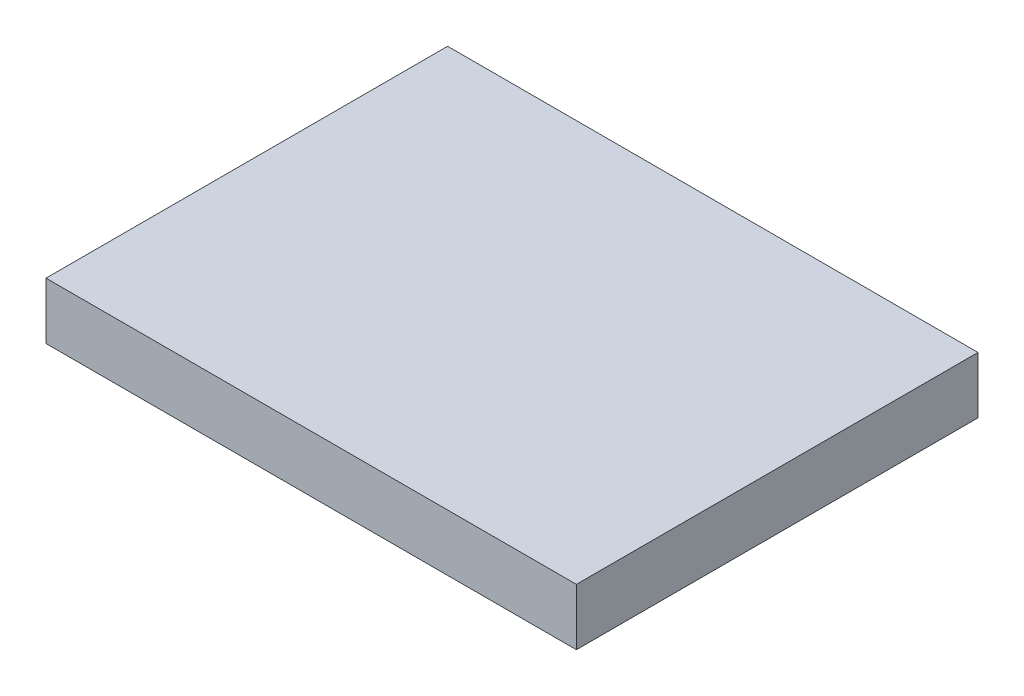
from build123d import *

# Parameters (mm, degrees)
ESBO_O1_W       = 206
ESBO_O1_H       = 156
EXTRUS_O1_DEPTH = 22


with BuildPart() as part:
    # Esbo_o1 → Extrus_o1 (new body)
    with BuildSketch(Plane(origin=(0, 0, 0), x_dir=(1, 0, 0), z_dir=(0, 1, 0))):
        Rectangle(ESBO_O1_W, ESBO_O1_H)
    extrude(amount=EXTRUS_O1_DEPTH)


solid = part.part
